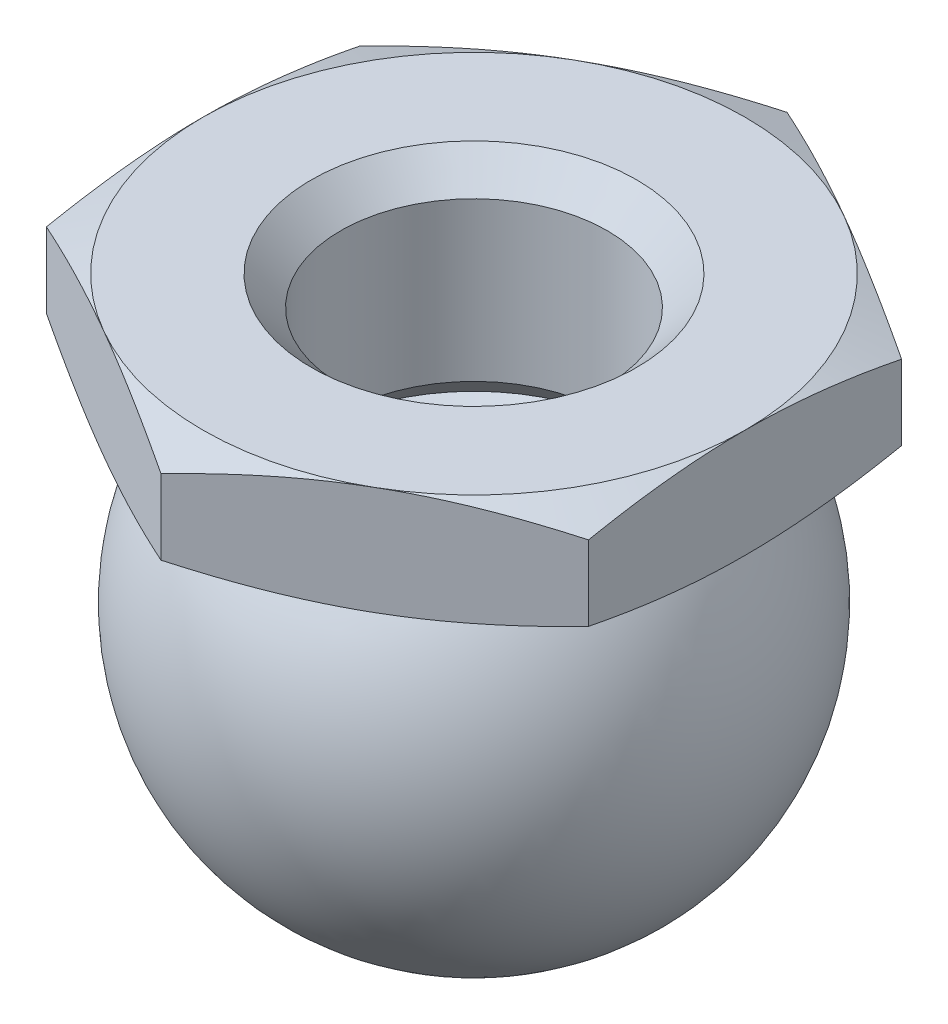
ISO-10303-21;
HEADER;
FILE_DESCRIPTION(('STEP AP214'),'2;1');
FILE_NAME('part.step','',(''),(''),'','','');
FILE_SCHEMA(('AUTOMOTIVE_DESIGN { 1 0 10303 214 1 1 1 1 }'));
ENDSEC;
DATA;
#1=APPLICATION_CONTEXT('core data for automotive mechanical design processes');
#2=APPLICATION_PROTOCOL_DEFINITION('international standard','automotive_design',2000,#1);
#3=PRODUCT_CONTEXT('',#1,'mechanical');
#4=PRODUCT('Part','Part','',(#3));
#5=PRODUCT_RELATED_PRODUCT_CATEGORY('part','',(#4));
#6=PRODUCT_DEFINITION_FORMATION('','',#4);
#7=PRODUCT_DEFINITION_CONTEXT('part definition',#1,'design');
#8=PRODUCT_DEFINITION('design','',#6,#7);
#9=PRODUCT_DEFINITION_SHAPE('','',#8);
#10=(LENGTH_UNIT() NAMED_UNIT(*) SI_UNIT(.MILLI.,.METRE.));
#11=(NAMED_UNIT(*) PLANE_ANGLE_UNIT() SI_UNIT($,.RADIAN.));
#12=(NAMED_UNIT(*) SI_UNIT($,.STERADIAN.) SOLID_ANGLE_UNIT());
#13=UNCERTAINTY_MEASURE_WITH_UNIT(LENGTH_MEASURE(1.E-05),#10,'distance_accuracy_value','');
#14=(GEOMETRIC_REPRESENTATION_CONTEXT(3) GLOBAL_UNCERTAINTY_ASSIGNED_CONTEXT((#13)) GLOBAL_UNIT_ASSIGNED_CONTEXT((#10,
#11,#12)) REPRESENTATION_CONTEXT('',''));
#15=CARTESIAN_POINT('',(0.,0.,0.));
#16=DIRECTION('',(0.,0.,1.));
#17=DIRECTION('',(1.,0.,0.));
#18=AXIS2_PLACEMENT_3D('',#15,#16,#17);
#19=CARTESIAN_POINT('',(0.,0.,0.));
#20=DIRECTION('',(0.,-1.,0.));
#21=DIRECTION('',(0.,0.,-1.));
#22=AXIS2_PLACEMENT_3D('',#19,#20,#21);
#23=CONICAL_SURFACE('',#22,5.,1.19028994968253);
#24=CARTESIAN_POINT('',(-5.,-0.309400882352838,2.88675037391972));
#25=CARTESIAN_POINT('',(-5.,-0.193860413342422,2.30904788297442));
#26=CARTESIAN_POINT('',(-5.,-0.103523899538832,1.7267699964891));
#27=CARTESIAN_POINT('',(-5.,-0.0175717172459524,0.760570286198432));
#28=CARTESIAN_POINT('',(-5.,1.83884114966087E-07,0.380951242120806));
#29=CARTESIAN_POINT('',(-5.,-1.45630035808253E-12,-6.0336677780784E-06));
#30=B_SPLINE_CURVE_WITH_KNOTS('',3,(#24,#25,#26,#27,#28,#29),.UNSPECIFIED.,.F.,.F.,(4,2,4),
(6.03667716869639,7.79108874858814,8.92828247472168),.UNSPECIFIED.);
#31=CARTESIAN_POINT('',(-5.,-0.309401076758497,2.8867513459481));
#32=VERTEX_POINT('',#31);
#33=CARTESIAN_POINT('',(-5.,0.,0.));
#34=VERTEX_POINT('',#33);
#35=EDGE_CURVE('E124',#32,#34,#30,.T.);
#36=ORIENTED_EDGE('',*,*,#35,.F.);
#37=CARTESIAN_POINT('',(-2.49999964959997,0.,4.33012722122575));
#38=CARTESIAN_POINT('',(-2.79315340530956,1.09569076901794E-08,4.16087482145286));
#39=CARTESIAN_POINT('',(-3.08474661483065,-0.0137819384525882,3.99252340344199));
#40=CARTESIAN_POINT('',(-3.67134482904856,-0.0676258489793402,3.65385076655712));
#41=CARTESIAN_POINT('',(-3.96468541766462,-0.107596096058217,3.48449049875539));
#42=CARTESIAN_POINT('',(-4.50539684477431,-0.201519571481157,3.1723106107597));
#43=CARTESIAN_POINT('',(-4.75350538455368,-0.252475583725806,3.02906507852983));
#44=CARTESIAN_POINT('',(-4.99999999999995,-0.309401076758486,2.88675134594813));
#45=B_SPLINE_CURVE_WITH_KNOTS('',3,(#37,#38,#39,#40,#41,#42,#43,#44),.UNSPECIFIED.,.F.,.F.,(4,2,
2,4),(2.89479379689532,3.90673569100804,4.91867758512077,5.77543696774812),.UNSPECIFIED.);
#46=CARTESIAN_POINT('',(-2.50000000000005,0.,4.33012701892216));
#47=VERTEX_POINT('',#46);
#48=EDGE_CURVE('E108',#47,#32,#45,.T.);
#49=ORIENTED_EDGE('',*,*,#48,.F.);
#50=CARTESIAN_POINT('',(0.,0.,0.));
#51=DIRECTION('',(0.,-1.,0.));
#52=DIRECTION('',(-0.500000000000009,0.,0.866025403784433));
#53=AXIS2_PLACEMENT_3D('',#50,#51,#52);
#54=CIRCLE('',#53,5.);
#55=EDGE_CURVE('E123',#47,#34,#54,.T.);
#56=ORIENTED_EDGE('',*,*,#55,.T.);
#57=EDGE_LOOP('',(#36,#49,#56));
#58=FACE_BOUND('',#57,.T.);
#59=ADVANCED_FACE('F17',(#58),#23,.T.);
#60=CARTESIAN_POINT('',(-5.,-2.,-2.8867513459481));
#61=DIRECTION('',(-1.,0.,0.));
#62=DIRECTION('',(0.,0.,1.));
#63=AXIS2_PLACEMENT_3D('',#60,#61,#62);
#64=PLANE('',#63);
#65=ORIENTED_EDGE('',*,*,#35,.T.);
#66=CARTESIAN_POINT('',(-5.,-1.45630035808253E-12,-6.0336677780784E-06));
#67=CARTESIAN_POINT('',(-5.,-2.34615320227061E-07,-0.486057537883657));
#68=CARTESIAN_POINT('',(-5.,-0.0289585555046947,-0.971346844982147));
#69=CARTESIAN_POINT('',(-5.,-0.136614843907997,-1.93554340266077));
#70=CARTESIAN_POINT('',(-5.,-0.21446080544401,-2.4120499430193));
#71=CARTESIAN_POINT('',(-5.,-0.309401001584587,-2.88675097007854));
#72=B_SPLINE_CURVE_WITH_KNOTS('',3,(#66,#67,#68,#69,#70,#71),.UNSPECIFIED.,.F.,.F.,(4,2,4),
(8.92828247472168,10.3970954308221,11.8659083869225),.UNSPECIFIED.);
#73=CARTESIAN_POINT('',(-5.,-0.309401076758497,-2.8867513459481));
#74=VERTEX_POINT('',#73);
#75=EDGE_CURVE('E221',#34,#74,#72,.T.);
#76=ORIENTED_EDGE('',*,*,#75,.T.);
#77=DIRECTION('',(0.,1.,0.));
#78=VECTOR('',#77,1.);
#79=CARTESIAN_POINT('',(-5.,-1.6905989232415,-2.8867513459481));
#80=LINE('',#79,#78);
#81=CARTESIAN_POINT('',(-5.,-1.6905989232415,-2.8867513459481));
#82=VERTEX_POINT('',#81);
#83=EDGE_CURVE('E230',#82,#74,#80,.T.);
#84=ORIENTED_EDGE('',*,*,#83,.F.);
#85=CARTESIAN_POINT('',(-5.,-1.69059911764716,-2.88675037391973));
#86=CARTESIAN_POINT('',(-5.,-1.80613958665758,-2.30904788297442));
#87=CARTESIAN_POINT('',(-5.,-1.89647610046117,-1.72676999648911));
#88=CARTESIAN_POINT('',(-5.,-1.98242828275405,-0.760570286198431));
#89=CARTESIAN_POINT('',(-5.,-2.00000018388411,-0.380951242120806));
#90=CARTESIAN_POINT('',(-5.,-1.99999999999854,6.03366777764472E-06));
#91=B_SPLINE_CURVE_WITH_KNOTS('',3,(#85,#86,#87,#88,#89,#90),.UNSPECIFIED.,.F.,.F.,(4,2,4),
(6.03667716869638,7.79108874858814,8.92828247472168),.UNSPECIFIED.);
#92=CARTESIAN_POINT('',(-5.,-2.,0.));
#93=VERTEX_POINT('',#92);
#94=EDGE_CURVE('E244',#82,#93,#91,.T.);
#95=ORIENTED_EDGE('',*,*,#94,.T.);
#96=CARTESIAN_POINT('',(-5.,-1.99999999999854,6.03366777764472E-06));
#97=CARTESIAN_POINT('',(-5.,-1.99999976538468,0.486057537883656));
#98=CARTESIAN_POINT('',(-5.,-1.97104144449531,0.971346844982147));
#99=CARTESIAN_POINT('',(-5.,-1.863385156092,1.93554340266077));
#100=CARTESIAN_POINT('',(-5.,-1.78553919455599,2.41204994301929));
#101=CARTESIAN_POINT('',(-5.,-1.69059899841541,2.88675097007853));
#102=B_SPLINE_CURVE_WITH_KNOTS('',3,(#96,#97,#98,#99,#100,#101),.UNSPECIFIED.,.F.,.F.,(4,2,4),
(8.92828247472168,10.3970954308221,11.8659083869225),.UNSPECIFIED.);
#103=CARTESIAN_POINT('',(-5.,-1.6905989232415,2.8867513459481));
#104=VERTEX_POINT('',#103);
#105=EDGE_CURVE('E135',#93,#104,#102,.T.);
#106=ORIENTED_EDGE('',*,*,#105,.T.);
#107=DIRECTION('',(0.,1.,0.));
#108=VECTOR('',#107,1.);
#109=CARTESIAN_POINT('',(-5.,-1.6905989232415,2.8867513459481));
#110=LINE('',#109,#108);
#111=EDGE_CURVE('E113',#104,#32,#110,.T.);
#112=ORIENTED_EDGE('',*,*,#111,.T.);
#113=EDGE_LOOP('',(#65,#76,#84,#95,#106,#112));
#114=FACE_BOUND('',#113,.T.);
#115=ADVANCED_FACE('F130',(#114),#64,.T.);
#116=CARTESIAN_POINT('',(-5.,-2.,2.8867513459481));
#117=DIRECTION('',(-0.500000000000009,0.,0.866025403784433));
#118=DIRECTION('',(0.866025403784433,0.,0.500000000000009));
#119=AXIS2_PLACEMENT_3D('',#116,#117,#118);
#120=PLANE('',#119);
#121=CARTESIAN_POINT('',(4.46760684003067E-11,-0.309401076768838,5.77350269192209));
#122=CARTESIAN_POINT('',(-0.413129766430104,-0.213992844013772,5.53498211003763));
#123=CARTESIAN_POINT('',(-0.829897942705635,-0.135583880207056,5.29436089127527));
#124=CARTESIAN_POINT('',(-1.66496463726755,-0.0284068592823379,4.81223491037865));
#125=CARTESIAN_POINT('',(-2.08113497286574,-1.56554985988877E-08,4.57195885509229));
#126=CARTESIAN_POINT('',(-2.49999964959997,0.,4.33012722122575));
#127=B_SPLINE_CURVE_WITH_KNOTS('',3,(#121,#122,#123,#124,#125,#126),.UNSPECIFIED.,.F.,.F.,(4,2,
4),(0.000232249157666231,1.44751302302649,2.89479379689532),.UNSPECIFIED.);
#128=CARTESIAN_POINT('',(0.,-0.30940107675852,5.7735026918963));
#129=VERTEX_POINT('',#128);
#130=EDGE_CURVE('E116',#129,#47,#127,.T.);
#131=ORIENTED_EDGE('',*,*,#130,.T.);
#132=ORIENTED_EDGE('',*,*,#48,.T.);
#133=ORIENTED_EDGE('',*,*,#111,.F.);
#134=CARTESIAN_POINT('',(-5.00000000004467,-1.69059892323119,2.88675134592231));
#135=CARTESIAN_POINT('',(-4.58687023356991,-1.78600715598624,3.12527192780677));
#136=CARTESIAN_POINT('',(-4.1701020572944,-1.86441611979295,3.36589314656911));
#137=CARTESIAN_POINT('',(-3.33503536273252,-1.97159314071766,3.84801912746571));
#138=CARTESIAN_POINT('',(-2.91886502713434,-1.9999999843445,4.08829518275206));
#139=CARTESIAN_POINT('',(-2.50000035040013,-1.99999999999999,4.33012681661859));
#140=B_SPLINE_CURVE_WITH_KNOTS('',3,(#134,#135,#136,#137,#138,#139),.UNSPECIFIED.,.F.,.F.,(4,2,
4),(0.000232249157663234,1.44751302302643,2.8947937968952),.UNSPECIFIED.);
#141=CARTESIAN_POINT('',(-2.50000000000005,-2.,4.33012701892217));
#142=VERTEX_POINT('',#141);
#143=EDGE_CURVE('E298',#104,#142,#140,.T.);
#144=ORIENTED_EDGE('',*,*,#143,.T.);
#145=CARTESIAN_POINT('',(-2.50000035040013,-1.99999999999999,4.33012681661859));
#146=CARTESIAN_POINT('',(-2.20684659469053,-2.00000001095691,4.49937921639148));
#147=CARTESIAN_POINT('',(-1.91525338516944,-1.98621806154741,4.66773063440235));
#148=CARTESIAN_POINT('',(-1.32865517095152,-1.93237415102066,5.00640327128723));
#149=CARTESIAN_POINT('',(-1.03531458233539,-1.89240390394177,5.175763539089));
#150=CARTESIAN_POINT('',(-0.494603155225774,-1.79848042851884,5.48794342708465));
#151=CARTESIAN_POINT('',(-0.246494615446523,-1.74752441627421,5.63118895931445));
#152=CARTESIAN_POINT('',(-3.12250225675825E-13,-1.69059892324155,5.77350269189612));
#153=B_SPLINE_CURVE_WITH_KNOTS('',3,(#145,#146,#147,#148,#149,#150,#151,#152),.UNSPECIFIED.,.F.,
.F.,(4,2,2,4),(2.8947937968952,3.90673569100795,4.91867758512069,5.77543696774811),.UNSPECIFIED.);
#154=CARTESIAN_POINT('',(0.,-1.69059892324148,5.7735026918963));
#155=VERTEX_POINT('',#154);
#156=EDGE_CURVE('E296',#142,#155,#153,.T.);
#157=ORIENTED_EDGE('',*,*,#156,.T.);
#158=DIRECTION('',(0.,1.,0.));
#159=VECTOR('',#158,1.);
#160=CARTESIAN_POINT('',(0.,-1.69059892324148,5.7735026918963));
#161=LINE('',#160,#159);
#162=EDGE_CURVE('E297',#155,#129,#161,.T.);
#163=ORIENTED_EDGE('',*,*,#162,.T.);
#164=EDGE_LOOP('',(#131,#132,#133,#144,#157,#163));
#165=FACE_BOUND('',#164,.T.);
#166=ADVANCED_FACE('F111',(#165),#120,.T.);
#167=CARTESIAN_POINT('',(3.,0.,0.));
#168=DIRECTION('',(0.,-1.,0.));
#169=DIRECTION('',(0.,0.,-1.));
#170=AXIS2_PLACEMENT_3D('',#167,#168,#169);
#171=PLANE('',#170);
#172=CARTESIAN_POINT('',(0.,0.,0.));
#173=DIRECTION('',(0.,-1.,0.));
#174=DIRECTION('',(1.,0.,0.));
#175=AXIS2_PLACEMENT_3D('',#172,#173,#174);
#176=CIRCLE('',#175,5.);
#177=CARTESIAN_POINT('',(5.,0.,0.));
#178=VERTEX_POINT('',#177);
#179=CARTESIAN_POINT('',(2.50000000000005,0.,4.33012701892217));
#180=VERTEX_POINT('',#179);
#181=EDGE_CURVE('E303',#178,#180,#176,.T.);
#182=ORIENTED_EDGE('',*,*,#181,.F.);
#183=CARTESIAN_POINT('',(0.,0.,0.));
#184=DIRECTION('',(0.,-1.,0.));
#185=DIRECTION('',(0.50000000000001,0.,-0.866025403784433));
#186=AXIS2_PLACEMENT_3D('',#183,#184,#185);
#187=CIRCLE('',#186,5.);
#188=CARTESIAN_POINT('',(2.50000000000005,0.,-4.33012701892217));
#189=VERTEX_POINT('',#188);
#190=EDGE_CURVE('E304',#189,#178,#187,.T.);
#191=ORIENTED_EDGE('',*,*,#190,.F.);
#192=CARTESIAN_POINT('',(0.,0.,0.));
#193=DIRECTION('',(0.,-1.,0.));
#194=DIRECTION('',(-0.50000000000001,0.,-0.866025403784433));
#195=AXIS2_PLACEMENT_3D('',#192,#193,#194);
#196=CIRCLE('',#195,5.);
#197=CARTESIAN_POINT('',(-2.50000000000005,0.,-4.33012701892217));
#198=VERTEX_POINT('',#197);
#199=EDGE_CURVE('E313',#198,#189,#196,.T.);
#200=ORIENTED_EDGE('',*,*,#199,.F.);
#201=CARTESIAN_POINT('',(0.,0.,0.));
#202=DIRECTION('',(0.,-1.,0.));
#203=DIRECTION('',(-1.,0.,0.));
#204=AXIS2_PLACEMENT_3D('',#201,#202,#203);
#205=CIRCLE('',#204,5.);
#206=EDGE_CURVE('E223',#34,#198,#205,.T.);
#207=ORIENTED_EDGE('',*,*,#206,.F.);
#208=ORIENTED_EDGE('',*,*,#55,.F.);
#209=CARTESIAN_POINT('',(0.,0.,0.));
#210=DIRECTION('',(0.,-1.,0.));
#211=DIRECTION('',(0.50000000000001,0.,0.866025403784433));
#212=AXIS2_PLACEMENT_3D('',#209,#210,#211);
#213=CIRCLE('',#212,5.);
#214=EDGE_CURVE('E321',#180,#47,#213,.T.);
#215=ORIENTED_EDGE('',*,*,#214,.F.);
#216=EDGE_LOOP('',(#182,#191,#200,#207,#208,#215));
#217=FACE_BOUND('',#216,.T.);
#218=CARTESIAN_POINT('',(0.,0.,0.));
#219=DIRECTION('',(0.,-1.,0.));
#220=DIRECTION('',(0.,0.,-1.));
#221=AXIS2_PLACEMENT_3D('',#218,#219,#220);
#222=CIRCLE('',#221,3.);
#223=CARTESIAN_POINT('',(0.,0.,-3.));
#224=VERTEX_POINT('',#223);
#225=EDGE_CURVE('E227',#224,#224,#222,.T.);
#226=ORIENTED_EDGE('',*,*,#225,.T.);
#227=EDGE_LOOP('',(#226));
#228=FACE_BOUND('',#227,.T.);
#229=ADVANCED_FACE('F275',(#217,#228),#171,.F.);
#230=ORIENTED_EDGE('',*,*,#75,.F.);
#231=ORIENTED_EDGE('',*,*,#206,.T.);
#232=CARTESIAN_POINT('',(-5.00000000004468,-0.309401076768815,-2.88675134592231));
#233=CARTESIAN_POINT('',(-4.58687023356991,-0.213992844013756,-3.12527192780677));
#234=CARTESIAN_POINT('',(-4.1701020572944,-0.135583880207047,-3.36589314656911));
#235=CARTESIAN_POINT('',(-3.33503536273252,-0.0284068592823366,-3.84801912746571));
#236=CARTESIAN_POINT('',(-2.91886502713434,-1.56554985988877E-08,-4.08829518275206));
#237=CARTESIAN_POINT('',(-2.50000035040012,0.,-4.33012681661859));
#238=B_SPLINE_CURVE_WITH_KNOTS('',3,(#232,#233,#234,#235,#236,#237),.UNSPECIFIED.,.F.,.F.,(4,2,
4),(0.000232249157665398,1.44751302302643,2.8947937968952),.UNSPECIFIED.);
#239=EDGE_CURVE('E220',#74,#198,#238,.T.);
#240=ORIENTED_EDGE('',*,*,#239,.F.);
#241=EDGE_LOOP('',(#230,#231,#240));
#242=FACE_BOUND('',#241,.T.);
#243=ADVANCED_FACE('F153',(#242),#23,.T.);
#244=CARTESIAN_POINT('',(0.,-2.,-5.7735026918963));
#245=DIRECTION('',(-0.500000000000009,0.,-0.866025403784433));
#246=DIRECTION('',(-0.866025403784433,0.,0.500000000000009));
#247=AXIS2_PLACEMENT_3D('',#244,#245,#246);
#248=PLANE('',#247);
#249=ORIENTED_EDGE('',*,*,#239,.T.);
#250=CARTESIAN_POINT('',(-2.50000035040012,0.,-4.33012681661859));
#251=CARTESIAN_POINT('',(-2.20684659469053,1.09569081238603E-08,-4.49937921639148));
#252=CARTESIAN_POINT('',(-1.91525338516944,-0.0137819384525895,-4.66773063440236));
#253=CARTESIAN_POINT('',(-1.32865517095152,-0.067625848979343,-5.00640327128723));
#254=CARTESIAN_POINT('',(-1.0353145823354,-0.107596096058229,-5.175763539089));
#255=CARTESIAN_POINT('',(-0.494603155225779,-0.201519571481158,-5.48794342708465));
#256=CARTESIAN_POINT('',(-0.246494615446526,-0.252475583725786,-5.63118895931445));
#257=CARTESIAN_POINT('',(-3.13734308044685E-13,-0.309401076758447,-5.77350269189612));
#258=B_SPLINE_CURVE_WITH_KNOTS('',3,(#250,#251,#252,#253,#254,#255,#256,#257),.UNSPECIFIED.,.F.,
.F.,(4,2,2,4),(2.8947937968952,3.90673569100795,4.91867758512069,5.77543696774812),.UNSPECIFIED.);
#259=CARTESIAN_POINT('',(0.,-0.30940107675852,-5.7735026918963));
#260=VERTEX_POINT('',#259);
#261=EDGE_CURVE('E226',#198,#260,#258,.T.);
#262=ORIENTED_EDGE('',*,*,#261,.T.);
#263=DIRECTION('',(0.,1.,0.));
#264=VECTOR('',#263,1.);
#265=CARTESIAN_POINT('',(0.,-1.69059892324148,-5.7735026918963));
#266=LINE('',#265,#264);
#267=CARTESIAN_POINT('',(0.,-1.69059892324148,-5.7735026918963));
#268=VERTEX_POINT('',#267);
#269=EDGE_CURVE('E390',#268,#260,#266,.T.);
#270=ORIENTED_EDGE('',*,*,#269,.F.);
#271=CARTESIAN_POINT('',(4.46751840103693E-11,-1.69059892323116,-5.77350269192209));
#272=CARTESIAN_POINT('',(-0.413129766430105,-1.78600715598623,-5.53498211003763));
#273=CARTESIAN_POINT('',(-0.829897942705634,-1.86441611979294,-5.29436089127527));
#274=CARTESIAN_POINT('',(-1.66496463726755,-1.97159314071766,-4.81223491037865));
#275=CARTESIAN_POINT('',(-2.08113497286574,-1.9999999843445,-4.57195885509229));
#276=CARTESIAN_POINT('',(-2.49999964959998,-1.99999999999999,-4.33012722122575));
#277=B_SPLINE_CURVE_WITH_KNOTS('',3,(#271,#272,#273,#274,#275,#276),.UNSPECIFIED.,.F.,.F.,(4,2,
4),(0.000232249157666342,1.44751302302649,2.89479379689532),.UNSPECIFIED.);
#278=CARTESIAN_POINT('',(-2.50000000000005,-2.,-4.33012701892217));
#279=VERTEX_POINT('',#278);
#280=EDGE_CURVE('E399',#268,#279,#277,.T.);
#281=ORIENTED_EDGE('',*,*,#280,.T.);
#282=CARTESIAN_POINT('',(-2.49999964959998,-1.99999999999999,-4.33012722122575));
#283=CARTESIAN_POINT('',(-2.79315340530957,-2.00000001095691,-4.16087482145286));
#284=CARTESIAN_POINT('',(-3.08474661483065,-1.98621806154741,-3.99252340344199));
#285=CARTESIAN_POINT('',(-3.67134482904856,-1.93237415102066,-3.65385076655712));
#286=CARTESIAN_POINT('',(-3.96468541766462,-1.89240390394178,-3.48449049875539));
#287=CARTESIAN_POINT('',(-4.50539684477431,-1.79848042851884,-3.1723106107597));
#288=CARTESIAN_POINT('',(-4.75350538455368,-1.74752441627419,-3.02906507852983));
#289=CARTESIAN_POINT('',(-4.99999999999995,-1.69059892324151,-2.88675134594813));
#290=B_SPLINE_CURVE_WITH_KNOTS('',3,(#282,#283,#284,#285,#286,#287,#288,#289),.UNSPECIFIED.,.F.,
.F.,(4,2,2,4),(2.89479379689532,3.90673569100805,4.91867758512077,5.77543696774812),.UNSPECIFIED.);
#291=EDGE_CURVE('E404',#279,#82,#290,.T.);
#292=ORIENTED_EDGE('',*,*,#291,.T.);
#293=ORIENTED_EDGE('',*,*,#83,.T.);
#294=EDGE_LOOP('',(#249,#262,#270,#281,#292,#293));
#295=FACE_BOUND('',#294,.T.);
#296=ADVANCED_FACE('F397',(#295),#248,.T.);
#297=CARTESIAN_POINT('',(0.,-1.5,0.));
#298=DIRECTION('',(0.,1.,0.));
#299=DIRECTION('',(0.,0.,1.));
#300=AXIS2_PLACEMENT_3D('',#297,#298,#299);
#301=CONICAL_SURFACE('',#300,6.25,1.19028994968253);
#302=ORIENTED_EDGE('',*,*,#291,.F.);
#303=CARTESIAN_POINT('',(0.,-2.,0.));
#304=DIRECTION('',(0.,-1.,0.));
#305=DIRECTION('',(-1.,0.,0.));
#306=AXIS2_PLACEMENT_3D('',#303,#304,#305);
#307=CIRCLE('',#306,5.);
#308=EDGE_CURVE('E445',#93,#279,#307,.T.);
#309=ORIENTED_EDGE('',*,*,#308,.F.);
#310=ORIENTED_EDGE('',*,*,#94,.F.);
#311=EDGE_LOOP('',(#302,#309,#310));
#312=FACE_BOUND('',#311,.T.);
#313=ADVANCED_FACE('F423',(#312),#301,.T.);
#314=ORIENTED_EDGE('',*,*,#105,.F.);
#315=CARTESIAN_POINT('',(0.,-2.,0.));
#316=DIRECTION('',(0.,-1.,0.));
#317=DIRECTION('',(-0.500000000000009,0.,0.866025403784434));
#318=AXIS2_PLACEMENT_3D('',#315,#316,#317);
#319=CIRCLE('',#318,5.);
#320=EDGE_CURVE('E452',#142,#93,#319,.T.);
#321=ORIENTED_EDGE('',*,*,#320,.F.);
#322=ORIENTED_EDGE('',*,*,#143,.F.);
#323=EDGE_LOOP('',(#314,#321,#322));
#324=FACE_BOUND('',#323,.T.);
#325=ADVANCED_FACE('F599',(#324),#301,.T.);
#326=CARTESIAN_POINT('',(2.50000035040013,0.,4.33012681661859));
#327=CARTESIAN_POINT('',(2.20684659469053,1.09569081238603E-08,4.49937921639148));
#328=CARTESIAN_POINT('',(1.91525338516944,-0.0137819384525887,4.66773063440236));
#329=CARTESIAN_POINT('',(1.32865517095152,-0.067625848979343,5.00640327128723));
#330=CARTESIAN_POINT('',(1.03531458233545,-0.107596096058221,5.17576353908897));
#331=CARTESIAN_POINT('',(0.494603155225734,-0.201519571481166,5.48794342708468));
#332=CARTESIAN_POINT('',(0.246494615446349,-0.252475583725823,5.63118895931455));
#333=CARTESIAN_POINT('',(0.,-0.309401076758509,5.77350269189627));
#334=B_SPLINE_CURVE_WITH_KNOTS('',3,(#326,#327,#328,#329,#330,#331,#332,#333),.UNSPECIFIED.,.F.,
.F.,(4,2,2,4),(2.8947937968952,3.90673569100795,4.91867758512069,5.77543696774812),.UNSPECIFIED.);
#335=EDGE_CURVE('E476',#180,#129,#334,.T.);
#336=ORIENTED_EDGE('',*,*,#335,.F.);
#337=ORIENTED_EDGE('',*,*,#214,.T.);
#338=ORIENTED_EDGE('',*,*,#130,.F.);
#339=EDGE_LOOP('',(#336,#337,#338));
#340=FACE_BOUND('',#339,.T.);
#341=ADVANCED_FACE('F490',(#340),#23,.T.);
#342=CARTESIAN_POINT('',(-5.07561291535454E-11,-1.69059892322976,5.7735026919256));
#343=CARTESIAN_POINT('',(0.413129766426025,-1.78600715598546,5.53498211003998));
#344=CARTESIAN_POINT('',(0.829897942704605,-1.86441611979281,5.29436089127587));
#345=CARTESIAN_POINT('',(1.66496463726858,-1.97159314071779,4.81223491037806));
#346=CARTESIAN_POINT('',(2.08113497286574,-1.9999999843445,4.57195885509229));
#347=CARTESIAN_POINT('',(2.49999964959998,-1.99999999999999,4.33012722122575));
#348=B_SPLINE_CURVE_WITH_KNOTS('',3,(#342,#343,#344,#345,#346,#347),.UNSPECIFIED.,.F.,.F.,(4,2,
4),(0.000232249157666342,1.44751302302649,2.89479379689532),.UNSPECIFIED.);
#349=CARTESIAN_POINT('',(2.50000000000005,-2.,4.33012701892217));
#350=VERTEX_POINT('',#349);
#351=EDGE_CURVE('E494',#155,#350,#348,.T.);
#352=ORIENTED_EDGE('',*,*,#351,.F.);
#353=ORIENTED_EDGE('',*,*,#156,.F.);
#354=CARTESIAN_POINT('',(0.,-2.,0.));
#355=DIRECTION('',(0.,-1.,0.));
#356=DIRECTION('',(0.50000000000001,0.,0.866025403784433));
#357=AXIS2_PLACEMENT_3D('',#354,#355,#356);
#358=CIRCLE('',#357,5.);
#359=EDGE_CURVE('E543',#350,#142,#358,.T.);
#360=ORIENTED_EDGE('',*,*,#359,.F.);
#361=EDGE_LOOP('',(#352,#353,#360));
#362=FACE_BOUND('',#361,.T.);
#363=ADVANCED_FACE('F564',(#362),#301,.T.);
#364=CARTESIAN_POINT('',(0.,-2.,5.7735026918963));
#365=DIRECTION('',(0.500000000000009,0.,0.866025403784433));
#366=DIRECTION('',(0.866025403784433,0.,-0.500000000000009));
#367=AXIS2_PLACEMENT_3D('',#364,#365,#366);
#368=PLANE('',#367);
#369=CARTESIAN_POINT('',(5.00000000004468,-0.309401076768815,2.88675134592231));
#370=CARTESIAN_POINT('',(4.58687023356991,-0.213992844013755,3.12527192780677));
#371=CARTESIAN_POINT('',(4.1701020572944,-0.135583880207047,3.36589314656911));
#372=CARTESIAN_POINT('',(3.33503536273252,-0.0284068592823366,3.84801912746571));
#373=CARTESIAN_POINT('',(2.91886502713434,-1.56554985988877E-08,4.08829518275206));
#374=CARTESIAN_POINT('',(2.50000035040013,0.,4.33012681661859));
#375=B_SPLINE_CURVE_WITH_KNOTS('',3,(#369,#370,#371,#372,#373,#374),.UNSPECIFIED.,.F.,.F.,(4,2,
4),(0.000232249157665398,1.44751302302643,2.8947937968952),.UNSPECIFIED.);
#376=CARTESIAN_POINT('',(5.,-0.309401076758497,2.8867513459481));
#377=VERTEX_POINT('',#376);
#378=EDGE_CURVE('E535',#377,#180,#375,.T.);
#379=ORIENTED_EDGE('',*,*,#378,.T.);
#380=ORIENTED_EDGE('',*,*,#335,.T.);
#381=ORIENTED_EDGE('',*,*,#162,.F.);
#382=ORIENTED_EDGE('',*,*,#351,.T.);
#383=CARTESIAN_POINT('',(2.49999964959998,-1.99999999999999,4.33012722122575));
#384=CARTESIAN_POINT('',(2.79315340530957,-2.00000001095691,4.16087482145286));
#385=CARTESIAN_POINT('',(3.08474661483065,-1.98621806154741,3.99252340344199));
#386=CARTESIAN_POINT('',(3.67134482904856,-1.93237415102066,3.65385076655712));
#387=CARTESIAN_POINT('',(3.96468541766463,-1.89240390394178,3.48449049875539));
#388=CARTESIAN_POINT('',(4.50539684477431,-1.79848042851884,3.1723106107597));
#389=CARTESIAN_POINT('',(4.75350538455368,-1.74752441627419,3.02906507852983));
#390=CARTESIAN_POINT('',(4.99999999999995,-1.69059892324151,2.88675134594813));
#391=B_SPLINE_CURVE_WITH_KNOTS('',3,(#383,#384,#385,#386,#387,#388,#389,#390),.UNSPECIFIED.,.F.,
.F.,(4,2,2,4),(2.89479379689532,3.90673569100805,4.91867758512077,5.77543696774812),.UNSPECIFIED.);
#392=CARTESIAN_POINT('',(5.,-1.6905989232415,2.8867513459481));
#393=VERTEX_POINT('',#392);
#394=EDGE_CURVE('E531',#350,#393,#391,.T.);
#395=ORIENTED_EDGE('',*,*,#394,.T.);
#396=DIRECTION('',(0.,1.,0.));
#397=VECTOR('',#396,1.);
#398=CARTESIAN_POINT('',(5.,-1.6905989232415,2.8867513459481));
#399=LINE('',#398,#397);
#400=EDGE_CURVE('E526',#393,#377,#399,.T.);
#401=ORIENTED_EDGE('',*,*,#400,.T.);
#402=EDGE_LOOP('',(#379,#380,#381,#382,#395,#401));
#403=FACE_BOUND('',#402,.T.);
#404=ADVANCED_FACE('F521',(#403),#368,.T.);
#405=CARTESIAN_POINT('',(5.,-1.45630035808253E-12,6.03366777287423E-06));
#406=CARTESIAN_POINT('',(5.,-2.34615320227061E-07,0.486057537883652));
#407=CARTESIAN_POINT('',(5.,-0.0289585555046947,0.971346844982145));
#408=CARTESIAN_POINT('',(5.,-0.136614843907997,1.93554340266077));
#409=CARTESIAN_POINT('',(5.,-0.21446080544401,2.41204994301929));
#410=CARTESIAN_POINT('',(5.,-0.309401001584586,2.88675097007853));
#411=B_SPLINE_CURVE_WITH_KNOTS('',3,(#405,#406,#407,#408,#409,#410),.UNSPECIFIED.,.F.,.F.,(4,2,
4),(8.92828247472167,10.3970954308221,11.8659083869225),.UNSPECIFIED.);
#412=EDGE_CURVE('E525',#178,#377,#411,.T.);
#413=ORIENTED_EDGE('',*,*,#412,.F.);
#414=ORIENTED_EDGE('',*,*,#181,.T.);
#415=ORIENTED_EDGE('',*,*,#378,.F.);
#416=EDGE_LOOP('',(#413,#414,#415));
#417=FACE_BOUND('',#416,.T.);
#418=ADVANCED_FACE('F516',(#417),#23,.T.);
#419=CARTESIAN_POINT('',(2.49999964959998,0.,-4.33012722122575));
#420=CARTESIAN_POINT('',(2.79315340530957,1.09569085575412E-08,-4.16087482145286));
#421=CARTESIAN_POINT('',(3.08474661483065,-0.0137819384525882,-3.99252340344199));
#422=CARTESIAN_POINT('',(3.67134482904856,-0.0676258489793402,-3.65385076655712));
#423=CARTESIAN_POINT('',(3.96468541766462,-0.107596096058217,-3.48449049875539));
#424=CARTESIAN_POINT('',(4.50539684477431,-0.201519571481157,-3.17231061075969));
#425=CARTESIAN_POINT('',(4.75350538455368,-0.252475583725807,-3.02906507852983));
#426=CARTESIAN_POINT('',(4.99999999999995,-0.309401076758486,-2.88675134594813));
#427=B_SPLINE_CURVE_WITH_KNOTS('',3,(#419,#420,#421,#422,#423,#424,#425,#426),.UNSPECIFIED.,.F.,
.F.,(4,2,2,4),(2.89479379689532,3.90673569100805,4.91867758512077,5.77543696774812),.UNSPECIFIED.);
#428=CARTESIAN_POINT('',(5.,-0.309401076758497,-2.8867513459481));
#429=VERTEX_POINT('',#428);
#430=EDGE_CURVE('E524',#189,#429,#427,.T.);
#431=ORIENTED_EDGE('',*,*,#430,.F.);
#432=ORIENTED_EDGE('',*,*,#190,.T.);
#433=CARTESIAN_POINT('',(5.,-0.309400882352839,-2.88675037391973));
#434=CARTESIAN_POINT('',(5.,-0.193860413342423,-2.30904788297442));
#435=CARTESIAN_POINT('',(5.,-0.103523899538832,-1.7267699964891));
#436=CARTESIAN_POINT('',(5.,-0.0175717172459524,-0.76057028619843));
#437=CARTESIAN_POINT('',(5.,1.83884114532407E-07,-0.380951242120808));
#438=CARTESIAN_POINT('',(5.,-1.45630035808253E-12,6.03366777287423E-06));
#439=B_SPLINE_CURVE_WITH_KNOTS('',3,(#433,#434,#435,#436,#437,#438),.UNSPECIFIED.,.F.,.F.,(4,2,
4),(6.03667716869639,7.79108874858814,8.92828247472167),.UNSPECIFIED.);
#440=EDGE_CURVE('E343',#429,#178,#439,.T.);
#441=ORIENTED_EDGE('',*,*,#440,.F.);
#442=EDGE_LOOP('',(#431,#432,#441));
#443=FACE_BOUND('',#442,.T.);
#444=ADVANCED_FACE('F511',(#443),#23,.T.);
#445=ORIENTED_EDGE('',*,*,#261,.F.);
#446=ORIENTED_EDGE('',*,*,#199,.T.);
#447=CARTESIAN_POINT('',(-5.07562741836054E-11,-0.309401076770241,-5.7735026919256));
#448=CARTESIAN_POINT('',(0.413129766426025,-0.21399284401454,-5.53498211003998));
#449=CARTESIAN_POINT('',(0.829897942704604,-0.135583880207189,-5.29436089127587));
#450=CARTESIAN_POINT('',(1.66496463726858,-0.0284068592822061,-4.81223491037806));
#451=CARTESIAN_POINT('',(2.08113497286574,-1.5655497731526E-08,-4.57195885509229));
#452=CARTESIAN_POINT('',(2.49999964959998,0.,-4.33012722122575));
#453=B_SPLINE_CURVE_WITH_KNOTS('',3,(#447,#448,#449,#450,#451,#452),.UNSPECIFIED.,.F.,.F.,(4,2,
4),(0.000232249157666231,1.44751302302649,2.89479379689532),.UNSPECIFIED.);
#454=EDGE_CURVE('E340',#260,#189,#453,.T.);
#455=ORIENTED_EDGE('',*,*,#454,.F.);
#456=EDGE_LOOP('',(#445,#446,#455));
#457=FACE_BOUND('',#456,.T.);
#458=ADVANCED_FACE('F152',(#457),#23,.T.);
#459=CARTESIAN_POINT('',(0.,-0.5415,0.));
#460=DIRECTION('',(0.,1.,0.));
#461=DIRECTION('',(0.,0.,1.));
#462=AXIS2_PLACEMENT_3D('',#459,#460,#461);
#463=CONICAL_SURFACE('',#462,2.4585,0.785398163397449);
#464=ORIENTED_EDGE('',*,*,#225,.F.);
#465=EDGE_LOOP('',(#464));
#466=FACE_BOUND('',#465,.T.);
#467=CARTESIAN_POINT('',(0.,-0.5415,0.));
#468=DIRECTION('',(0.,-1.,0.));
#469=DIRECTION('',(0.,0.,-1.));
#470=AXIS2_PLACEMENT_3D('',#467,#468,#469);
#471=CIRCLE('',#470,2.4585);
#472=CARTESIAN_POINT('',(0.,-0.5415,-2.4585));
#473=VERTEX_POINT('',#472);
#474=EDGE_CURVE('E337',#473,#473,#471,.T.);
#475=ORIENTED_EDGE('',*,*,#474,.T.);
#476=EDGE_LOOP('',(#475));
#477=FACE_BOUND('',#476,.T.);
#478=ADVANCED_FACE('F330',(#466,#477),#463,.F.);
#479=CARTESIAN_POINT('',(5.,-2.,-2.8867513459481));
#480=DIRECTION('',(0.500000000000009,0.,-0.866025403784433));
#481=DIRECTION('',(-0.866025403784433,0.,-0.500000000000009));
#482=AXIS2_PLACEMENT_3D('',#479,#480,#481);
#483=PLANE('',#482);
#484=ORIENTED_EDGE('',*,*,#454,.T.);
#485=ORIENTED_EDGE('',*,*,#430,.T.);
#486=DIRECTION('',(0.,1.,0.));
#487=VECTOR('',#486,1.);
#488=CARTESIAN_POINT('',(5.,-1.6905989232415,-2.8867513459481));
#489=LINE('',#488,#487);
#490=CARTESIAN_POINT('',(5.,-1.6905989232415,-2.8867513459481));
#491=VERTEX_POINT('',#490);
#492=EDGE_CURVE('E339',#491,#429,#489,.T.);
#493=ORIENTED_EDGE('',*,*,#492,.F.);
#494=CARTESIAN_POINT('',(5.00000000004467,-1.69059892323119,-2.88675134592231));
#495=CARTESIAN_POINT('',(4.58687023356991,-1.78600715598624,-3.12527192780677));
#496=CARTESIAN_POINT('',(4.17010205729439,-1.86441611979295,-3.36589314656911));
#497=CARTESIAN_POINT('',(3.33503536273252,-1.97159314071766,-3.84801912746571));
#498=CARTESIAN_POINT('',(2.91886502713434,-1.9999999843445,-4.08829518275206));
#499=CARTESIAN_POINT('',(2.50000035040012,-1.99999999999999,-4.33012681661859));
#500=B_SPLINE_CURVE_WITH_KNOTS('',3,(#494,#495,#496,#497,#498,#499),.UNSPECIFIED.,.F.,.F.,(4,2,
4),(0.000232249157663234,1.44751302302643,2.8947937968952),.UNSPECIFIED.);
#501=CARTESIAN_POINT('',(2.50000000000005,-2.,-4.33012701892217));
#502=VERTEX_POINT('',#501);
#503=EDGE_CURVE('E341',#491,#502,#500,.T.);
#504=ORIENTED_EDGE('',*,*,#503,.T.);
#505=CARTESIAN_POINT('',(2.50000035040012,-1.99999999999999,-4.33012681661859));
#506=CARTESIAN_POINT('',(2.20684659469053,-2.00000001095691,-4.49937921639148));
#507=CARTESIAN_POINT('',(1.91525338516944,-1.98621806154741,-4.66773063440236));
#508=CARTESIAN_POINT('',(1.32865517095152,-1.93237415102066,-5.00640327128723));
#509=CARTESIAN_POINT('',(1.03531458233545,-1.89240390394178,-5.17576353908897));
#510=CARTESIAN_POINT('',(0.494603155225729,-1.79848042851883,-5.48794342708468));
#511=CARTESIAN_POINT('',(0.246494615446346,-1.74752441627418,-5.63118895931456));
#512=CARTESIAN_POINT('',(0.,-1.69059892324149,-5.77350269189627));
#513=B_SPLINE_CURVE_WITH_KNOTS('',3,(#505,#506,#507,#508,#509,#510,#511,#512),.UNSPECIFIED.,.F.,
.F.,(4,2,2,4),(2.8947937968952,3.90673569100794,4.91867758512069,5.77543696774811),.UNSPECIFIED.);
#514=EDGE_CURVE('E388',#502,#268,#513,.T.);
#515=ORIENTED_EDGE('',*,*,#514,.T.);
#516=ORIENTED_EDGE('',*,*,#269,.T.);
#517=EDGE_LOOP('',(#484,#485,#493,#504,#515,#516));
#518=FACE_BOUND('',#517,.T.);
#519=ADVANCED_FACE('F333',(#518),#483,.T.);
#520=ORIENTED_EDGE('',*,*,#514,.F.);
#521=CARTESIAN_POINT('',(0.,-2.,0.));
#522=DIRECTION('',(0.,-1.,0.));
#523=DIRECTION('',(-0.50000000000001,0.,-0.866025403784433));
#524=AXIS2_PLACEMENT_3D('',#521,#522,#523);
#525=CIRCLE('',#524,5.);
#526=EDGE_CURVE('E395',#279,#502,#525,.T.);
#527=ORIENTED_EDGE('',*,*,#526,.F.);
#528=ORIENTED_EDGE('',*,*,#280,.F.);
#529=EDGE_LOOP('',(#520,#527,#528));
#530=FACE_BOUND('',#529,.T.);
#531=ADVANCED_FACE('F363',(#530),#301,.T.);
#532=CARTESIAN_POINT('',(5.,-2.,0.));
#533=DIRECTION('',(0.,1.,0.));
#534=DIRECTION('',(0.,0.,1.));
#535=AXIS2_PLACEMENT_3D('',#532,#533,#534);
#536=PLANE('',#535);
#537=CARTESIAN_POINT('',(0.,-2.,0.));
#538=DIRECTION('',(0.,-1.,0.));
#539=DIRECTION('',(0.,0.,-1.));
#540=AXIS2_PLACEMENT_3D('',#537,#538,#539);
#541=CIRCLE('',#540,3.66708330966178);
#542=CARTESIAN_POINT('',(0.,-2.,-3.66708330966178));
#543=VERTEX_POINT('',#542);
#544=EDGE_CURVE('E914',#543,#543,#541,.T.);
#545=ORIENTED_EDGE('',*,*,#544,.F.);
#546=EDGE_LOOP('',(#545));
#547=FACE_BOUND('',#546,.T.);
#548=CARTESIAN_POINT('',(0.,-2.,0.));
#549=DIRECTION('',(0.,-1.,0.));
#550=DIRECTION('',(0.50000000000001,0.,-0.866025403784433));
#551=AXIS2_PLACEMENT_3D('',#548,#549,#550);
#552=CIRCLE('',#551,5.);
#553=CARTESIAN_POINT('',(5.,-2.,0.));
#554=VERTEX_POINT('',#553);
#555=EDGE_CURVE('E588',#502,#554,#552,.T.);
#556=ORIENTED_EDGE('',*,*,#555,.T.);
#557=CARTESIAN_POINT('',(0.,-2.,0.));
#558=DIRECTION('',(0.,-1.,0.));
#559=DIRECTION('',(1.,0.,0.));
#560=AXIS2_PLACEMENT_3D('',#557,#558,#559);
#561=CIRCLE('',#560,5.);
#562=EDGE_CURVE('E582',#554,#350,#561,.T.);
#563=ORIENTED_EDGE('',*,*,#562,.T.);
#564=ORIENTED_EDGE('',*,*,#359,.T.);
#565=ORIENTED_EDGE('',*,*,#320,.T.);
#566=ORIENTED_EDGE('',*,*,#308,.T.);
#567=ORIENTED_EDGE('',*,*,#526,.T.);
#568=EDGE_LOOP('',(#556,#563,#564,#565,#566,#567));
#569=FACE_BOUND('',#568,.T.);
#570=ADVANCED_FACE('F365',(#547,#569),#536,.F.);
#571=CARTESIAN_POINT('',(5.,-1.69059911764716,2.88675037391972));
#572=CARTESIAN_POINT('',(5.,-1.80613958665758,2.30904788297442));
#573=CARTESIAN_POINT('',(5.,-1.89647610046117,1.7267699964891));
#574=CARTESIAN_POINT('',(5.,-1.98242828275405,0.760570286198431));
#575=CARTESIAN_POINT('',(5.,-2.00000018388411,0.380951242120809));
#576=CARTESIAN_POINT('',(5.,-1.99999999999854,-6.03366777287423E-06));
#577=B_SPLINE_CURVE_WITH_KNOTS('',3,(#571,#572,#573,#574,#575,#576),.UNSPECIFIED.,.F.,.F.,(4,2,
4),(6.03667716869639,7.79108874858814,8.92828247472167),.UNSPECIFIED.);
#578=EDGE_CURVE('E584',#393,#554,#577,.T.);
#579=ORIENTED_EDGE('',*,*,#578,.F.);
#580=ORIENTED_EDGE('',*,*,#394,.F.);
#581=ORIENTED_EDGE('',*,*,#562,.F.);
#582=EDGE_LOOP('',(#579,#580,#581));
#583=FACE_BOUND('',#582,.T.);
#584=ADVANCED_FACE('F581',(#583),#301,.T.);
#585=CARTESIAN_POINT('',(5.,-2.,2.8867513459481));
#586=DIRECTION('',(1.,0.,0.));
#587=DIRECTION('',(0.,0.,-1.));
#588=AXIS2_PLACEMENT_3D('',#585,#586,#587);
#589=PLANE('',#588);
#590=ORIENTED_EDGE('',*,*,#440,.T.);
#591=ORIENTED_EDGE('',*,*,#412,.T.);
#592=ORIENTED_EDGE('',*,*,#400,.F.);
#593=ORIENTED_EDGE('',*,*,#578,.T.);
#594=CARTESIAN_POINT('',(5.,-1.99999999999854,-6.03366777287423E-06));
#595=CARTESIAN_POINT('',(5.,-1.99999976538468,-0.486057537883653));
#596=CARTESIAN_POINT('',(5.,-1.9710414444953,-0.971346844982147));
#597=CARTESIAN_POINT('',(5.,-1.863385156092,-1.93554340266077));
#598=CARTESIAN_POINT('',(5.,-1.78553919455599,-2.4120499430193));
#599=CARTESIAN_POINT('',(5.,-1.69059899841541,-2.88675097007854));
#600=B_SPLINE_CURVE_WITH_KNOTS('',3,(#594,#595,#596,#597,#598,#599),.UNSPECIFIED.,.F.,.F.,(4,2,
4),(8.92828247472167,10.3970954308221,11.8659083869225),.UNSPECIFIED.);
#601=EDGE_CURVE('E35',#554,#491,#600,.T.);
#602=ORIENTED_EDGE('',*,*,#601,.T.);
#603=ORIENTED_EDGE('',*,*,#492,.T.);
#604=EDGE_LOOP('',(#590,#591,#592,#593,#602,#603));
#605=FACE_BOUND('',#604,.T.);
#606=ADVANCED_FACE('F610',(#605),#589,.T.);
#607=CARTESIAN_POINT('',(0.,-2.,0.));
#608=DIRECTION('',(0.,-1.,0.));
#609=DIRECTION('',(0.,0.,-1.));
#610=AXIS2_PLACEMENT_3D('',#607,#608,#609);
#611=CYLINDRICAL_SURFACE('',#610,2.4585);
#612=ORIENTED_EDGE('',*,*,#474,.F.);
#613=EDGE_LOOP('',(#612));
#614=FACE_BOUND('',#613,.T.);
#615=CARTESIAN_POINT('',(0.,-3.4585,0.));
#616=DIRECTION('',(0.,-1.,0.));
#617=DIRECTION('',(0.,0.,-1.));
#618=AXIS2_PLACEMENT_3D('',#615,#616,#617);
#619=CIRCLE('',#618,2.4585);
#620=CARTESIAN_POINT('',(0.,-3.4585,-2.4585));
#621=VERTEX_POINT('',#620);
#622=EDGE_CURVE('E25',#621,#621,#619,.T.);
#623=ORIENTED_EDGE('',*,*,#622,.T.);
#624=EDGE_LOOP('',(#623));
#625=FACE_BOUND('',#624,.T.);
#626=ADVANCED_FACE('F615',(#614,#625),#611,.F.);
#627=ORIENTED_EDGE('',*,*,#503,.F.);
#628=ORIENTED_EDGE('',*,*,#601,.F.);
#629=ORIENTED_EDGE('',*,*,#555,.F.);
#630=EDGE_LOOP('',(#627,#628,#629));
#631=FACE_BOUND('',#630,.T.);
#632=ADVANCED_FACE('F611',(#631),#301,.T.);
#633=CARTESIAN_POINT('',(0.,-5.25,0.));
#634=DIRECTION('',(0.,-1.,0.));
#635=DIRECTION('',(1.,0.,0.));
#636=AXIS2_PLACEMENT_3D('',#633,#634,#635);
#637=SPHERICAL_SURFACE('',#636,4.9);
#638=ORIENTED_EDGE('',*,*,#544,.T.);
#639=EDGE_LOOP('',(#638));
#640=FACE_BOUND('',#639,.T.);
#641=ADVANCED_FACE('F617',(#640),#637,.T.);
#642=CARTESIAN_POINT('',(0.,-4.,0.));
#643=DIRECTION('',(0.,-1.,0.));
#644=DIRECTION('',(0.,0.,-1.));
#645=AXIS2_PLACEMENT_3D('',#642,#643,#644);
#646=CONICAL_SURFACE('',#645,3.,0.785398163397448);
#647=ORIENTED_EDGE('',*,*,#622,.F.);
#648=EDGE_LOOP('',(#647));
#649=FACE_BOUND('',#648,.T.);
#650=CARTESIAN_POINT('',(0.,-4.,0.));
#651=DIRECTION('',(0.,-1.,0.));
#652=DIRECTION('',(0.,0.,-1.));
#653=AXIS2_PLACEMENT_3D('',#650,#651,#652);
#654=CIRCLE('',#653,3.);
#655=CARTESIAN_POINT('',(0.,-4.,-3.));
#656=VERTEX_POINT('',#655);
#657=EDGE_CURVE('E11',#656,#656,#654,.T.);
#658=ORIENTED_EDGE('',*,*,#657,.T.);
#659=EDGE_LOOP('',(#658));
#660=FACE_BOUND('',#659,.T.);
#661=ADVANCED_FACE('F622',(#649,#660),#646,.F.);
#662=CARTESIAN_POINT('',(0.,-5.398922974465,0.));
#663=DIRECTION('',(0.,1.,0.));
#664=DIRECTION('',(0.,0.,1.));
#665=AXIS2_PLACEMENT_3D('',#662,#663,#664);
#666=CONICAL_SURFACE('',#665,0.,1.13446401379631);
#667=ORIENTED_EDGE('',*,*,#657,.F.);
#668=EDGE_LOOP('',(#667));
#669=FACE_BOUND('',#668,.T.);
#670=CARTESIAN_POINT('',(0.,-5.398922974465,0.));
#671=VERTEX_POINT('',#670);
#672=VERTEX_LOOP('',#671);
#673=FACE_BOUND('',#672,.T.);
#674=ADVANCED_FACE('F19',(#669,#673),#666,.F.);
#675=CLOSED_SHELL('',(#59,#115,#166,#229,#243,#296,#313,#325,#341,#363,#404,#418,#444,#458,#478,
#519,#531,#570,#584,#606,#626,#632,#641,#661,#674));
#676=MANIFOLD_SOLID_BREP('B1',#675);
#677=ADVANCED_BREP_SHAPE_REPRESENTATION('',(#18,#676),#14);
#678=SHAPE_DEFINITION_REPRESENTATION(#9,#677);
ENDSEC;
END-ISO-10303-21;
